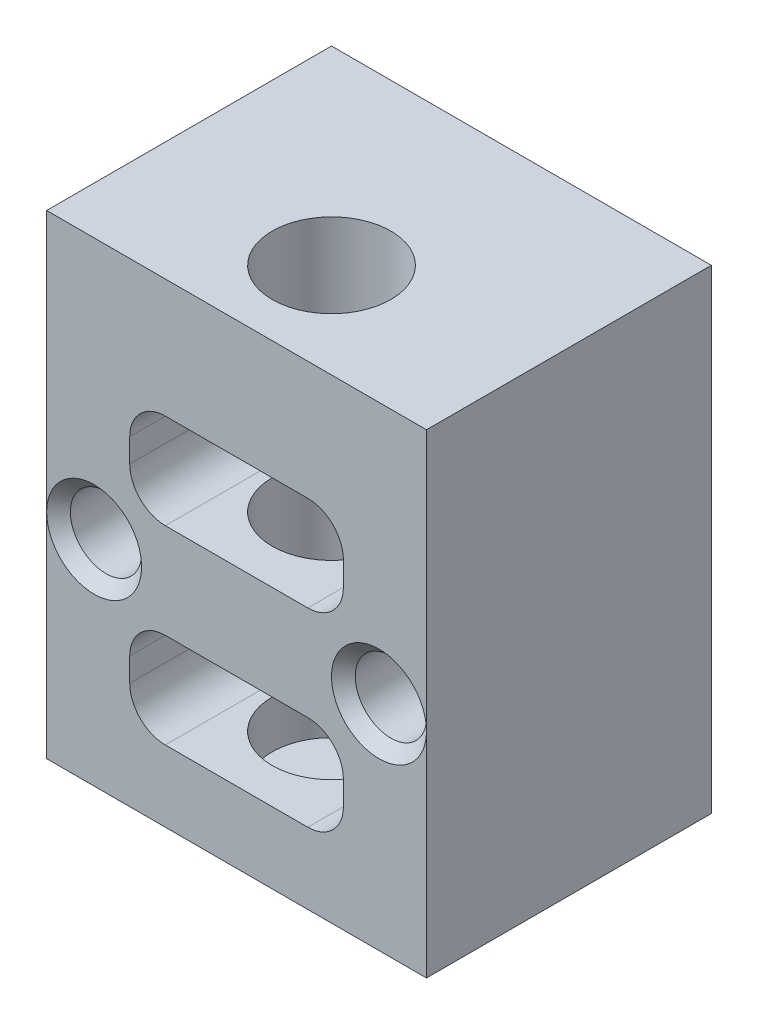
ISO-10303-21;
HEADER;
FILE_DESCRIPTION(('STEP AP214'),'2;1');
FILE_NAME('part.step','',(''),(''),'','','');
FILE_SCHEMA(('AUTOMOTIVE_DESIGN { 1 0 10303 214 1 1 1 1 }'));
ENDSEC;
DATA;
#1=APPLICATION_CONTEXT('core data for automotive mechanical design processes');
#2=APPLICATION_PROTOCOL_DEFINITION('international standard','automotive_design',2000,#1);
#3=PRODUCT_CONTEXT('',#1,'mechanical');
#4=PRODUCT('Part','Part','',(#3));
#5=PRODUCT_RELATED_PRODUCT_CATEGORY('part','',(#4));
#6=PRODUCT_DEFINITION_FORMATION('','',#4);
#7=PRODUCT_DEFINITION_CONTEXT('part definition',#1,'design');
#8=PRODUCT_DEFINITION('design','',#6,#7);
#9=PRODUCT_DEFINITION_SHAPE('','',#8);
#10=(LENGTH_UNIT() NAMED_UNIT(*) SI_UNIT(.MILLI.,.METRE.));
#11=(NAMED_UNIT(*) PLANE_ANGLE_UNIT() SI_UNIT($,.RADIAN.));
#12=(NAMED_UNIT(*) SI_UNIT($,.STERADIAN.) SOLID_ANGLE_UNIT());
#13=UNCERTAINTY_MEASURE_WITH_UNIT(LENGTH_MEASURE(1.E-05),#10,'distance_accuracy_value','');
#14=(GEOMETRIC_REPRESENTATION_CONTEXT(3) GLOBAL_UNCERTAINTY_ASSIGNED_CONTEXT((#13)) GLOBAL_UNIT_ASSIGNED_CONTEXT((#10,
#11,#12)) REPRESENTATION_CONTEXT('',''));
#15=CARTESIAN_POINT('',(0.,0.,0.));
#16=DIRECTION('',(0.,0.,1.));
#17=DIRECTION('',(1.,0.,0.));
#18=AXIS2_PLACEMENT_3D('',#15,#16,#17);
#19=CARTESIAN_POINT('',(0.,-9.,8.));
#20=DIRECTION('',(0.,1.,0.));
#21=DIRECTION('',(0.,0.,1.));
#22=AXIS2_PLACEMENT_3D('',#19,#20,#21);
#23=CYLINDRICAL_SURFACE('',#22,2.5);
#24=CARTESIAN_POINT('',(0.,5.,8.));
#25=DIRECTION('',(0.,1.,0.));
#26=DIRECTION('',(0.,0.,1.));
#27=AXIS2_PLACEMENT_3D('',#24,#25,#26);
#28=CIRCLE('',#27,2.5);
#29=CARTESIAN_POINT('',(0.,5.,10.5));
#30=VERTEX_POINT('',#29);
#31=EDGE_CURVE('E362',#30,#30,#28,.F.);
#32=ORIENTED_EDGE('',*,*,#31,.T.);
#33=EDGE_LOOP('',(#32));
#34=FACE_BOUND('',#33,.T.);
#35=CARTESIAN_POINT('',(0.,10.,8.));
#36=DIRECTION('',(0.,1.,0.));
#37=DIRECTION('',(0.,0.,1.));
#38=AXIS2_PLACEMENT_3D('',#35,#36,#37);
#39=CIRCLE('',#38,2.5);
#40=CARTESIAN_POINT('',(0.,10.,10.5));
#41=VERTEX_POINT('',#40);
#42=EDGE_CURVE('E320',#41,#41,#39,.T.);
#43=ORIENTED_EDGE('',*,*,#42,.T.);
#44=EDGE_LOOP('',(#43));
#45=FACE_BOUND('',#44,.T.);
#46=ADVANCED_FACE('F35',(#34,#45),#23,.F.);
#47=CARTESIAN_POINT('',(8.,-10.,12.));
#48=DIRECTION('',(-1.,0.,0.));
#49=DIRECTION('',(0.,0.,1.));
#50=AXIS2_PLACEMENT_3D('',#47,#48,#49);
#51=PLANE('',#50);
#52=DIRECTION('',(0.,1.,0.));
#53=VECTOR('',#52,1.);
#54=CARTESIAN_POINT('',(8.,-10.,0.));
#55=LINE('',#54,#53);
#56=CARTESIAN_POINT('',(8.,-10.,0.));
#57=VERTEX_POINT('',#56);
#58=CARTESIAN_POINT('',(8.,10.,0.));
#59=VERTEX_POINT('',#58);
#60=EDGE_CURVE('E319',#57,#59,#55,.T.);
#61=ORIENTED_EDGE('',*,*,#60,.T.);
#62=DIRECTION('',(0.,0.,-1.));
#63=VECTOR('',#62,1.);
#64=CARTESIAN_POINT('',(8.,10.,12.));
#65=LINE('',#64,#63);
#66=CARTESIAN_POINT('',(8.,10.,12.));
#67=VERTEX_POINT('',#66);
#68=EDGE_CURVE('E353',#67,#59,#65,.T.);
#69=ORIENTED_EDGE('',*,*,#68,.F.);
#70=DIRECTION('',(0.,1.,0.));
#71=VECTOR('',#70,1.);
#72=CARTESIAN_POINT('',(8.,-10.,12.));
#73=LINE('',#72,#71);
#74=CARTESIAN_POINT('',(8.,-0.999999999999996,12.));
#75=VERTEX_POINT('',#74);
#76=EDGE_CURVE('E328',#75,#67,#73,.T.);
#77=ORIENTED_EDGE('',*,*,#76,.F.);
#78=CARTESIAN_POINT('',(8.,-10.,12.));
#79=VERTEX_POINT('',#78);
#80=EDGE_CURVE('E324',#79,#75,#73,.T.);
#81=ORIENTED_EDGE('',*,*,#80,.F.);
#82=DIRECTION('',(0.,0.,-1.));
#83=VECTOR('',#82,1.);
#84=CARTESIAN_POINT('',(8.,-10.,12.));
#85=LINE('',#84,#83);
#86=EDGE_CURVE('E336',#79,#57,#85,.T.);
#87=ORIENTED_EDGE('',*,*,#86,.T.);
#88=EDGE_LOOP('',(#61,#69,#77,#81,#87));
#89=FACE_BOUND('',#88,.T.);
#90=ADVANCED_FACE('F381',(#89),#51,.F.);
#91=CARTESIAN_POINT('',(-8.,10.,12.));
#92=DIRECTION('',(0.,-1.,0.));
#93=DIRECTION('',(0.,0.,-1.));
#94=AXIS2_PLACEMENT_3D('',#91,#92,#93);
#95=PLANE('',#94);
#96=ORIENTED_EDGE('',*,*,#42,.F.);
#97=EDGE_LOOP('',(#96));
#98=FACE_BOUND('',#97,.T.);
#99=DIRECTION('',(-1.,0.,0.));
#100=VECTOR('',#99,1.);
#101=CARTESIAN_POINT('',(-8.,10.,0.));
#102=LINE('',#101,#100);
#103=CARTESIAN_POINT('',(-8.,10.,0.));
#104=VERTEX_POINT('',#103);
#105=EDGE_CURVE('E339',#59,#104,#102,.T.);
#106=ORIENTED_EDGE('',*,*,#105,.T.);
#107=DIRECTION('',(0.,0.,-1.));
#108=VECTOR('',#107,1.);
#109=CARTESIAN_POINT('',(-8.,10.,12.));
#110=LINE('',#109,#108);
#111=CARTESIAN_POINT('',(-8.,10.,12.));
#112=VERTEX_POINT('',#111);
#113=EDGE_CURVE('E350',#112,#104,#110,.T.);
#114=ORIENTED_EDGE('',*,*,#113,.F.);
#115=DIRECTION('',(-1.,0.,0.));
#116=VECTOR('',#115,1.);
#117=CARTESIAN_POINT('',(-8.,10.,12.));
#118=LINE('',#117,#116);
#119=EDGE_CURVE('E327',#67,#112,#118,.T.);
#120=ORIENTED_EDGE('',*,*,#119,.F.);
#121=ORIENTED_EDGE('',*,*,#68,.T.);
#122=EDGE_LOOP('',(#106,#114,#120,#121));
#123=FACE_BOUND('',#122,.T.);
#124=ADVANCED_FACE('F384',(#98,#123),#95,.F.);
#125=CARTESIAN_POINT('',(-8.,-10.,12.));
#126=DIRECTION('',(1.,0.,0.));
#127=DIRECTION('',(0.,0.,-1.));
#128=AXIS2_PLACEMENT_3D('',#125,#126,#127);
#129=PLANE('',#128);
#130=DIRECTION('',(0.,-1.,0.));
#131=VECTOR('',#130,1.);
#132=CARTESIAN_POINT('',(-8.,-10.,0.));
#133=LINE('',#132,#131);
#134=CARTESIAN_POINT('',(-8.,-10.,0.));
#135=VERTEX_POINT('',#134);
#136=EDGE_CURVE('E341',#104,#135,#133,.T.);
#137=ORIENTED_EDGE('',*,*,#136,.T.);
#138=DIRECTION('',(0.,0.,-1.));
#139=VECTOR('',#138,1.);
#140=CARTESIAN_POINT('',(-8.,-10.,12.));
#141=LINE('',#140,#139);
#142=CARTESIAN_POINT('',(-8.,-10.,12.));
#143=VERTEX_POINT('',#142);
#144=EDGE_CURVE('E347',#143,#135,#141,.T.);
#145=ORIENTED_EDGE('',*,*,#144,.F.);
#146=DIRECTION('',(0.,-1.,0.));
#147=VECTOR('',#146,1.);
#148=CARTESIAN_POINT('',(-8.,-10.,12.));
#149=LINE('',#148,#147);
#150=CARTESIAN_POINT('',(-8.,-0.999999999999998,12.));
#151=VERTEX_POINT('',#150);
#152=EDGE_CURVE('E330',#151,#143,#149,.T.);
#153=ORIENTED_EDGE('',*,*,#152,.F.);
#154=EDGE_CURVE('E331',#112,#151,#149,.T.);
#155=ORIENTED_EDGE('',*,*,#154,.F.);
#156=ORIENTED_EDGE('',*,*,#113,.T.);
#157=EDGE_LOOP('',(#137,#145,#153,#155,#156));
#158=FACE_BOUND('',#157,.T.);
#159=ADVANCED_FACE('F389',(#158),#129,.F.);
#160=CARTESIAN_POINT('',(-8.,-10.,12.));
#161=DIRECTION('',(0.,1.,0.));
#162=DIRECTION('',(0.,0.,1.));
#163=AXIS2_PLACEMENT_3D('',#160,#161,#162);
#164=PLANE('',#163);
#165=DIRECTION('',(1.,0.,0.));
#166=VECTOR('',#165,1.);
#167=CARTESIAN_POINT('',(-8.,-10.,0.));
#168=LINE('',#167,#166);
#169=EDGE_CURVE('E343',#135,#57,#168,.T.);
#170=ORIENTED_EDGE('',*,*,#169,.T.);
#171=ORIENTED_EDGE('',*,*,#86,.F.);
#172=DIRECTION('',(1.,0.,0.));
#173=VECTOR('',#172,1.);
#174=CARTESIAN_POINT('',(-8.,-10.,12.));
#175=LINE('',#174,#173);
#176=EDGE_CURVE('E334',#143,#79,#175,.T.);
#177=ORIENTED_EDGE('',*,*,#176,.F.);
#178=ORIENTED_EDGE('',*,*,#144,.T.);
#179=EDGE_LOOP('',(#170,#171,#177,#178));
#180=FACE_BOUND('',#179,.T.);
#181=ADVANCED_FACE('F395',(#180),#164,.F.);
#182=CARTESIAN_POINT('',(0.,0.,12.));
#183=DIRECTION('',(0.,0.,-1.));
#184=DIRECTION('',(-1.,0.,0.));
#185=AXIS2_PLACEMENT_3D('',#182,#183,#184);
#186=PLANE('',#185);
#187=DIRECTION('',(-1.,0.,0.));
#188=VECTOR('',#187,1.);
#189=CARTESIAN_POINT('',(-3.,5.,12.));
#190=LINE('',#189,#188);
#191=CARTESIAN_POINT('',(3.,5.,12.));
#192=VERTEX_POINT('',#191);
#193=CARTESIAN_POINT('',(-3.,5.,12.));
#194=VERTEX_POINT('',#193);
#195=EDGE_CURVE('E221',#192,#194,#190,.T.);
#196=ORIENTED_EDGE('',*,*,#195,.F.);
#197=CARTESIAN_POINT('',(3.,3.5,12.));
#198=DIRECTION('',(0.,0.,1.));
#199=DIRECTION('',(-1.,0.,0.));
#200=AXIS2_PLACEMENT_3D('',#197,#198,#199);
#201=CIRCLE('',#200,1.5);
#202=CARTESIAN_POINT('',(4.5,3.5,12.));
#203=VERTEX_POINT('',#202);
#204=EDGE_CURVE('E182',#203,#192,#201,.T.);
#205=ORIENTED_EDGE('',*,*,#204,.F.);
#206=DIRECTION('',(0.,1.,0.));
#207=VECTOR('',#206,1.);
#208=CARTESIAN_POINT('',(4.5,3.5,12.));
#209=LINE('',#208,#207);
#210=CARTESIAN_POINT('',(4.5,2.5,12.));
#211=VERTEX_POINT('',#210);
#212=EDGE_CURVE('E201',#211,#203,#209,.T.);
#213=ORIENTED_EDGE('',*,*,#212,.F.);
#214=CARTESIAN_POINT('',(3.,2.5,12.));
#215=DIRECTION('',(0.,0.,1.));
#216=DIRECTION('',(1.,0.,0.));
#217=AXIS2_PLACEMENT_3D('',#214,#215,#216);
#218=CIRCLE('',#217,1.5);
#219=CARTESIAN_POINT('',(3.,1.,12.));
#220=VERTEX_POINT('',#219);
#221=EDGE_CURVE('E204',#220,#211,#218,.T.);
#222=ORIENTED_EDGE('',*,*,#221,.F.);
#223=DIRECTION('',(1.,0.,0.));
#224=VECTOR('',#223,1.);
#225=CARTESIAN_POINT('',(-3.,1.,12.));
#226=LINE('',#225,#224);
#227=CARTESIAN_POINT('',(-3.,1.,12.));
#228=VERTEX_POINT('',#227);
#229=EDGE_CURVE('E233',#228,#220,#226,.T.);
#230=ORIENTED_EDGE('',*,*,#229,.F.);
#231=CARTESIAN_POINT('',(-3.,2.5,12.));
#232=DIRECTION('',(0.,0.,1.));
#233=DIRECTION('',(1.,0.,0.));
#234=AXIS2_PLACEMENT_3D('',#231,#232,#233);
#235=CIRCLE('',#234,1.5);
#236=CARTESIAN_POINT('',(-4.5,2.5,12.));
#237=VERTEX_POINT('',#236);
#238=EDGE_CURVE('E230',#237,#228,#235,.T.);
#239=ORIENTED_EDGE('',*,*,#238,.F.);
#240=DIRECTION('',(0.,-1.,0.));
#241=VECTOR('',#240,1.);
#242=CARTESIAN_POINT('',(-4.5,3.5,12.));
#243=LINE('',#242,#241);
#244=CARTESIAN_POINT('',(-4.5,3.5,12.));
#245=VERTEX_POINT('',#244);
#246=EDGE_CURVE('E227',#245,#237,#243,.T.);
#247=ORIENTED_EDGE('',*,*,#246,.F.);
#248=CARTESIAN_POINT('',(-3.,3.5,12.));
#249=DIRECTION('',(0.,0.,1.));
#250=DIRECTION('',(1.,0.,0.));
#251=AXIS2_PLACEMENT_3D('',#248,#249,#250);
#252=CIRCLE('',#251,1.5);
#253=EDGE_CURVE('E224',#194,#245,#252,.T.);
#254=ORIENTED_EDGE('',*,*,#253,.F.);
#255=EDGE_LOOP('',(#196,#205,#213,#222,#230,#239,#247,#254));
#256=FACE_BOUND('',#255,.T.);
#257=DIRECTION('',(1.,0.,0.));
#258=VECTOR('',#257,1.);
#259=CARTESIAN_POINT('',(-3.,-7.,12.));
#260=LINE('',#259,#258);
#261=CARTESIAN_POINT('',(-3.,-7.,12.));
#262=VERTEX_POINT('',#261);
#263=CARTESIAN_POINT('',(3.,-7.,12.));
#264=VERTEX_POINT('',#263);
#265=EDGE_CURVE('E280',#262,#264,#260,.T.);
#266=ORIENTED_EDGE('',*,*,#265,.F.);
#267=CARTESIAN_POINT('',(-3.,-5.5,12.));
#268=DIRECTION('',(0.,0.,1.));
#269=DIRECTION('',(-1.,0.,0.));
#270=AXIS2_PLACEMENT_3D('',#267,#268,#269);
#271=CIRCLE('',#270,1.5);
#272=CARTESIAN_POINT('',(-4.5,-5.5,12.));
#273=VERTEX_POINT('',#272);
#274=EDGE_CURVE('E278',#273,#262,#271,.T.);
#275=ORIENTED_EDGE('',*,*,#274,.F.);
#276=DIRECTION('',(0.,-1.,0.));
#277=VECTOR('',#276,1.);
#278=CARTESIAN_POINT('',(-4.5,-5.5,12.));
#279=LINE('',#278,#277);
#280=CARTESIAN_POINT('',(-4.5,-4.5,12.));
#281=VERTEX_POINT('',#280);
#282=EDGE_CURVE('E256',#281,#273,#279,.T.);
#283=ORIENTED_EDGE('',*,*,#282,.F.);
#284=CARTESIAN_POINT('',(-3.,-4.5,12.));
#285=DIRECTION('',(0.,0.,1.));
#286=DIRECTION('',(-1.,0.,0.));
#287=AXIS2_PLACEMENT_3D('',#284,#285,#286);
#288=CIRCLE('',#287,1.5);
#289=CARTESIAN_POINT('',(-3.,-3.,12.));
#290=VERTEX_POINT('',#289);
#291=EDGE_CURVE('E296',#290,#281,#288,.T.);
#292=ORIENTED_EDGE('',*,*,#291,.F.);
#293=DIRECTION('',(-1.,0.,0.));
#294=VECTOR('',#293,1.);
#295=CARTESIAN_POINT('',(-3.,-3.,12.));
#296=LINE('',#295,#294);
#297=CARTESIAN_POINT('',(3.,-3.,12.));
#298=VERTEX_POINT('',#297);
#299=EDGE_CURVE('E293',#298,#290,#296,.T.);
#300=ORIENTED_EDGE('',*,*,#299,.F.);
#301=CARTESIAN_POINT('',(3.,-4.5,12.));
#302=DIRECTION('',(0.,0.,1.));
#303=DIRECTION('',(-1.,0.,0.));
#304=AXIS2_PLACEMENT_3D('',#301,#302,#303);
#305=CIRCLE('',#304,1.5);
#306=CARTESIAN_POINT('',(4.5,-4.5,12.));
#307=VERTEX_POINT('',#306);
#308=EDGE_CURVE('E290',#307,#298,#305,.T.);
#309=ORIENTED_EDGE('',*,*,#308,.F.);
#310=DIRECTION('',(0.,1.,0.));
#311=VECTOR('',#310,1.);
#312=CARTESIAN_POINT('',(4.5,-5.5,12.));
#313=LINE('',#312,#311);
#314=CARTESIAN_POINT('',(4.5,-5.5,12.));
#315=VERTEX_POINT('',#314);
#316=EDGE_CURVE('E287',#315,#307,#313,.T.);
#317=ORIENTED_EDGE('',*,*,#316,.F.);
#318=CARTESIAN_POINT('',(3.,-5.5,12.));
#319=DIRECTION('',(0.,0.,1.));
#320=DIRECTION('',(1.,0.,0.));
#321=AXIS2_PLACEMENT_3D('',#318,#319,#320);
#322=CIRCLE('',#321,1.5);
#323=EDGE_CURVE('E284',#264,#315,#322,.T.);
#324=ORIENTED_EDGE('',*,*,#323,.F.);
#325=EDGE_LOOP('',(#266,#275,#283,#292,#300,#309,#317,#324));
#326=FACE_BOUND('',#325,.T.);
#327=ORIENTED_EDGE('',*,*,#80,.T.);
#328=CARTESIAN_POINT('',(6.,-0.999999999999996,12.));
#329=DIRECTION('',(0.,0.,-1.));
#330=DIRECTION('',(-1.,0.,0.));
#331=AXIS2_PLACEMENT_3D('',#328,#329,#330);
#332=CIRCLE('',#331,2.);
#333=EDGE_CURVE('E43',#75,#75,#332,.T.);
#334=ORIENTED_EDGE('',*,*,#333,.T.);
#335=ORIENTED_EDGE('',*,*,#76,.T.);
#336=ORIENTED_EDGE('',*,*,#119,.T.);
#337=ORIENTED_EDGE('',*,*,#154,.T.);
#338=CARTESIAN_POINT('',(-6.,-0.999999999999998,12.));
#339=DIRECTION('',(0.,0.,-1.));
#340=DIRECTION('',(-1.,0.,0.));
#341=AXIS2_PLACEMENT_3D('',#338,#339,#340);
#342=CIRCLE('',#341,2.);
#343=EDGE_CURVE('E48',#151,#151,#342,.T.);
#344=ORIENTED_EDGE('',*,*,#343,.T.);
#345=ORIENTED_EDGE('',*,*,#152,.T.);
#346=ORIENTED_EDGE('',*,*,#176,.T.);
#347=EDGE_LOOP('',(#327,#334,#335,#336,#337,#344,#345,#346));
#348=FACE_BOUND('',#347,.T.);
#349=ADVANCED_FACE('F376',(#256,#326,#348),#186,.F.);
#350=CARTESIAN_POINT('',(0.,0.,0.));
#351=DIRECTION('',(0.,0.,-1.));
#352=DIRECTION('',(-1.,0.,0.));
#353=AXIS2_PLACEMENT_3D('',#350,#351,#352);
#354=PLANE('',#353);
#355=CARTESIAN_POINT('',(-6.,-0.999999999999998,0.));
#356=DIRECTION('',(0.,0.,-1.));
#357=DIRECTION('',(-1.,0.,0.));
#358=AXIS2_PLACEMENT_3D('',#355,#356,#357);
#359=CIRCLE('',#358,1.5);
#360=CARTESIAN_POINT('',(-7.5,-0.999999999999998,0.));
#361=VERTEX_POINT('',#360);
#362=EDGE_CURVE('E281',#361,#361,#359,.T.);
#363=ORIENTED_EDGE('',*,*,#362,.F.);
#364=EDGE_LOOP('',(#363));
#365=FACE_BOUND('',#364,.T.);
#366=CARTESIAN_POINT('',(6.,-0.999999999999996,0.));
#367=DIRECTION('',(0.,0.,-1.));
#368=DIRECTION('',(-1.,0.,0.));
#369=AXIS2_PLACEMENT_3D('',#366,#367,#368);
#370=CIRCLE('',#369,1.5);
#371=CARTESIAN_POINT('',(4.5,-0.999999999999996,0.));
#372=VERTEX_POINT('',#371);
#373=EDGE_CURVE('E367',#372,#372,#370,.T.);
#374=ORIENTED_EDGE('',*,*,#373,.F.);
#375=EDGE_LOOP('',(#374));
#376=FACE_BOUND('',#375,.T.);
#377=ORIENTED_EDGE('',*,*,#60,.F.);
#378=ORIENTED_EDGE('',*,*,#169,.F.);
#379=ORIENTED_EDGE('',*,*,#136,.F.);
#380=ORIENTED_EDGE('',*,*,#105,.F.);
#381=EDGE_LOOP('',(#377,#378,#379,#380));
#382=FACE_BOUND('',#381,.T.);
#383=ADVANCED_FACE('F398',(#365,#376,#382),#354,.T.);
#384=CARTESIAN_POINT('',(-3.,-3.,3.5));
#385=DIRECTION('',(0.,1.,0.));
#386=DIRECTION('',(0.,0.,1.));
#387=AXIS2_PLACEMENT_3D('',#384,#385,#386);
#388=PLANE('',#387);
#389=ORIENTED_EDGE('',*,*,#299,.T.);
#390=DIRECTION('',(0.,0.,1.));
#391=VECTOR('',#390,1.);
#392=CARTESIAN_POINT('',(-3.,-3.,3.5));
#393=LINE('',#392,#391);
#394=CARTESIAN_POINT('',(-3.,-3.,3.5));
#395=VERTEX_POINT('',#394);
#396=EDGE_CURVE('E304',#395,#290,#393,.T.);
#397=ORIENTED_EDGE('',*,*,#396,.F.);
#398=DIRECTION('',(-1.,0.,0.));
#399=VECTOR('',#398,1.);
#400=CARTESIAN_POINT('',(-3.,-3.,3.5));
#401=LINE('',#400,#399);
#402=CARTESIAN_POINT('',(3.,-3.,3.5));
#403=VERTEX_POINT('',#402);
#404=EDGE_CURVE('E268',#403,#395,#401,.T.);
#405=ORIENTED_EDGE('',*,*,#404,.F.);
#406=DIRECTION('',(0.,0.,1.));
#407=VECTOR('',#406,1.);
#408=CARTESIAN_POINT('',(3.,-3.,3.5));
#409=LINE('',#408,#407);
#410=EDGE_CURVE('E306',#403,#298,#409,.T.);
#411=ORIENTED_EDGE('',*,*,#410,.T.);
#412=EDGE_LOOP('',(#389,#397,#405,#411));
#413=FACE_BOUND('',#412,.T.);
#414=CARTESIAN_POINT('',(0.,-3.,8.));
#415=DIRECTION('',(0.,1.,0.));
#416=DIRECTION('',(0.,0.,1.));
#417=AXIS2_PLACEMENT_3D('',#414,#415,#416);
#418=CIRCLE('',#417,2.5);
#419=CARTESIAN_POINT('',(0.,-3.,10.5));
#420=VERTEX_POINT('',#419);
#421=EDGE_CURVE('E359',#420,#420,#418,.F.);
#422=ORIENTED_EDGE('',*,*,#421,.F.);
#423=EDGE_LOOP('',(#422));
#424=FACE_BOUND('',#423,.T.);
#425=ADVANCED_FACE('F400',(#413,#424),#388,.F.);
#426=CARTESIAN_POINT('',(-3.,-7.,3.5));
#427=DIRECTION('',(0.,-1.,0.));
#428=DIRECTION('',(0.,0.,-1.));
#429=AXIS2_PLACEMENT_3D('',#426,#427,#428);
#430=PLANE('',#429);
#431=ORIENTED_EDGE('',*,*,#265,.T.);
#432=DIRECTION('',(0.,0.,1.));
#433=VECTOR('',#432,1.);
#434=CARTESIAN_POINT('',(3.,-7.,3.5));
#435=LINE('',#434,#433);
#436=CARTESIAN_POINT('',(3.,-7.,3.5));
#437=VERTEX_POINT('',#436);
#438=EDGE_CURVE('E312',#437,#264,#435,.T.);
#439=ORIENTED_EDGE('',*,*,#438,.F.);
#440=DIRECTION('',(1.,0.,0.));
#441=VECTOR('',#440,1.);
#442=CARTESIAN_POINT('',(-3.,-7.,3.5));
#443=LINE('',#442,#441);
#444=CARTESIAN_POINT('',(-3.,-7.,3.5));
#445=VERTEX_POINT('',#444);
#446=EDGE_CURVE('E255',#445,#437,#443,.T.);
#447=ORIENTED_EDGE('',*,*,#446,.F.);
#448=DIRECTION('',(0.,0.,1.));
#449=VECTOR('',#448,1.);
#450=CARTESIAN_POINT('',(-3.,-7.,3.5));
#451=LINE('',#450,#449);
#452=EDGE_CURVE('E277',#445,#262,#451,.T.);
#453=ORIENTED_EDGE('',*,*,#452,.T.);
#454=EDGE_LOOP('',(#431,#439,#447,#453));
#455=FACE_BOUND('',#454,.T.);
#456=CARTESIAN_POINT('',(0.,-7.,8.));
#457=DIRECTION('',(0.,-1.,0.));
#458=DIRECTION('',(0.,0.,-1.));
#459=AXIS2_PLACEMENT_3D('',#456,#457,#458);
#460=CIRCLE('',#459,2.5);
#461=CARTESIAN_POINT('',(0.,-7.,5.5));
#462=VERTEX_POINT('',#461);
#463=EDGE_CURVE('E240',#462,#462,#460,.F.);
#464=ORIENTED_EDGE('',*,*,#463,.F.);
#465=EDGE_LOOP('',(#464));
#466=FACE_BOUND('',#465,.T.);
#467=ADVANCED_FACE('F407',(#455,#466),#430,.F.);
#468=CARTESIAN_POINT('',(-3.,-5.5,3.5));
#469=DIRECTION('',(0.,0.,1.));
#470=DIRECTION('',(1.,0.,0.));
#471=AXIS2_PLACEMENT_3D('',#468,#469,#470);
#472=CYLINDRICAL_SURFACE('',#471,1.5);
#473=ORIENTED_EDGE('',*,*,#274,.T.);
#474=ORIENTED_EDGE('',*,*,#452,.F.);
#475=CARTESIAN_POINT('',(-3.,-5.5,3.5));
#476=DIRECTION('',(0.,0.,1.));
#477=DIRECTION('',(-1.,0.,0.));
#478=AXIS2_PLACEMENT_3D('',#475,#476,#477);
#479=CIRCLE('',#478,1.5);
#480=CARTESIAN_POINT('',(-4.5,-5.5,3.5));
#481=VERTEX_POINT('',#480);
#482=EDGE_CURVE('E252',#481,#445,#479,.T.);
#483=ORIENTED_EDGE('',*,*,#482,.F.);
#484=DIRECTION('',(0.,0.,1.));
#485=VECTOR('',#484,1.);
#486=CARTESIAN_POINT('',(-4.5,-5.5,3.5));
#487=LINE('',#486,#485);
#488=EDGE_CURVE('E222',#481,#273,#487,.T.);
#489=ORIENTED_EDGE('',*,*,#488,.T.);
#490=EDGE_LOOP('',(#473,#474,#483,#489));
#491=FACE_BOUND('',#490,.T.);
#492=ADVANCED_FACE('F461',(#491),#472,.F.);
#493=CARTESIAN_POINT('',(-4.5,-5.5,3.5));
#494=DIRECTION('',(-1.,0.,0.));
#495=DIRECTION('',(0.,0.,1.));
#496=AXIS2_PLACEMENT_3D('',#493,#494,#495);
#497=PLANE('',#496);
#498=ORIENTED_EDGE('',*,*,#282,.T.);
#499=ORIENTED_EDGE('',*,*,#488,.F.);
#500=DIRECTION('',(0.,-1.,0.));
#501=VECTOR('',#500,1.);
#502=CARTESIAN_POINT('',(-4.5,-5.5,3.5));
#503=LINE('',#502,#501);
#504=CARTESIAN_POINT('',(-4.5,-4.5,3.5));
#505=VERTEX_POINT('',#504);
#506=EDGE_CURVE('E274',#505,#481,#503,.T.);
#507=ORIENTED_EDGE('',*,*,#506,.F.);
#508=DIRECTION('',(0.,0.,1.));
#509=VECTOR('',#508,1.);
#510=CARTESIAN_POINT('',(-4.5,-4.5,3.5));
#511=LINE('',#510,#509);
#512=EDGE_CURVE('E302',#505,#281,#511,.T.);
#513=ORIENTED_EDGE('',*,*,#512,.T.);
#514=EDGE_LOOP('',(#498,#499,#507,#513));
#515=FACE_BOUND('',#514,.T.);
#516=ADVANCED_FACE('F457',(#515),#497,.F.);
#517=CARTESIAN_POINT('',(-3.,-4.5,3.5));
#518=DIRECTION('',(0.,0.,1.));
#519=DIRECTION('',(1.,0.,0.));
#520=AXIS2_PLACEMENT_3D('',#517,#518,#519);
#521=CYLINDRICAL_SURFACE('',#520,1.5);
#522=ORIENTED_EDGE('',*,*,#291,.T.);
#523=ORIENTED_EDGE('',*,*,#512,.F.);
#524=CARTESIAN_POINT('',(-3.,-4.5,3.5));
#525=DIRECTION('',(0.,0.,1.));
#526=DIRECTION('',(-1.,0.,0.));
#527=AXIS2_PLACEMENT_3D('',#524,#525,#526);
#528=CIRCLE('',#527,1.5);
#529=EDGE_CURVE('E271',#395,#505,#528,.T.);
#530=ORIENTED_EDGE('',*,*,#529,.F.);
#531=ORIENTED_EDGE('',*,*,#396,.T.);
#532=EDGE_LOOP('',(#522,#523,#530,#531));
#533=FACE_BOUND('',#532,.T.);
#534=ADVANCED_FACE('F460',(#533),#521,.F.);
#535=CARTESIAN_POINT('',(3.,-4.5,3.5));
#536=DIRECTION('',(0.,0.,1.));
#537=DIRECTION('',(1.,0.,0.));
#538=AXIS2_PLACEMENT_3D('',#535,#536,#537);
#539=CYLINDRICAL_SURFACE('',#538,1.5);
#540=ORIENTED_EDGE('',*,*,#308,.T.);
#541=ORIENTED_EDGE('',*,*,#410,.F.);
#542=CARTESIAN_POINT('',(3.,-4.5,3.5));
#543=DIRECTION('',(0.,0.,1.));
#544=DIRECTION('',(-1.,0.,0.));
#545=AXIS2_PLACEMENT_3D('',#542,#543,#544);
#546=CIRCLE('',#545,1.5);
#547=CARTESIAN_POINT('',(4.5,-4.5,3.5));
#548=VERTEX_POINT('',#547);
#549=EDGE_CURVE('E265',#548,#403,#546,.T.);
#550=ORIENTED_EDGE('',*,*,#549,.F.);
#551=DIRECTION('',(0.,0.,1.));
#552=VECTOR('',#551,1.);
#553=CARTESIAN_POINT('',(4.5,-4.5,3.5));
#554=LINE('',#553,#552);
#555=EDGE_CURVE('E308',#548,#307,#554,.T.);
#556=ORIENTED_EDGE('',*,*,#555,.T.);
#557=EDGE_LOOP('',(#540,#541,#550,#556));
#558=FACE_BOUND('',#557,.T.);
#559=ADVANCED_FACE('F464',(#558),#539,.F.);
#560=CARTESIAN_POINT('',(4.5,-5.5,3.5));
#561=DIRECTION('',(1.,0.,0.));
#562=DIRECTION('',(0.,0.,-1.));
#563=AXIS2_PLACEMENT_3D('',#560,#561,#562);
#564=PLANE('',#563);
#565=ORIENTED_EDGE('',*,*,#316,.T.);
#566=ORIENTED_EDGE('',*,*,#555,.F.);
#567=DIRECTION('',(0.,1.,0.));
#568=VECTOR('',#567,1.);
#569=CARTESIAN_POINT('',(4.5,-5.5,3.5));
#570=LINE('',#569,#568);
#571=CARTESIAN_POINT('',(4.5,-5.5,3.5));
#572=VERTEX_POINT('',#571);
#573=EDGE_CURVE('E262',#572,#548,#570,.T.);
#574=ORIENTED_EDGE('',*,*,#573,.F.);
#575=DIRECTION('',(0.,0.,1.));
#576=VECTOR('',#575,1.);
#577=CARTESIAN_POINT('',(4.5,-5.5,3.5));
#578=LINE('',#577,#576);
#579=EDGE_CURVE('E310',#572,#315,#578,.T.);
#580=ORIENTED_EDGE('',*,*,#579,.T.);
#581=EDGE_LOOP('',(#565,#566,#574,#580));
#582=FACE_BOUND('',#581,.T.);
#583=ADVANCED_FACE('F451',(#582),#564,.F.);
#584=CARTESIAN_POINT('',(3.,-5.5,3.5));
#585=DIRECTION('',(0.,0.,1.));
#586=DIRECTION('',(1.,0.,0.));
#587=AXIS2_PLACEMENT_3D('',#584,#585,#586);
#588=CYLINDRICAL_SURFACE('',#587,1.5);
#589=ORIENTED_EDGE('',*,*,#323,.T.);
#590=ORIENTED_EDGE('',*,*,#579,.F.);
#591=CARTESIAN_POINT('',(3.,-5.5,3.5));
#592=DIRECTION('',(0.,0.,1.));
#593=DIRECTION('',(1.,0.,0.));
#594=AXIS2_PLACEMENT_3D('',#591,#592,#593);
#595=CIRCLE('',#594,1.5);
#596=EDGE_CURVE('E259',#437,#572,#595,.T.);
#597=ORIENTED_EDGE('',*,*,#596,.F.);
#598=ORIENTED_EDGE('',*,*,#438,.T.);
#599=EDGE_LOOP('',(#589,#590,#597,#598));
#600=FACE_BOUND('',#599,.T.);
#601=ADVANCED_FACE('F440',(#600),#588,.F.);
#602=CARTESIAN_POINT('',(-3.,-5.5,3.5));
#603=DIRECTION('',(0.,0.,-1.));
#604=DIRECTION('',(-1.,0.,0.));
#605=AXIS2_PLACEMENT_3D('',#602,#603,#604);
#606=PLANE('',#605);
#607=ORIENTED_EDGE('',*,*,#482,.T.);
#608=ORIENTED_EDGE('',*,*,#446,.T.);
#609=ORIENTED_EDGE('',*,*,#596,.T.);
#610=ORIENTED_EDGE('',*,*,#573,.T.);
#611=ORIENTED_EDGE('',*,*,#549,.T.);
#612=ORIENTED_EDGE('',*,*,#404,.T.);
#613=ORIENTED_EDGE('',*,*,#529,.T.);
#614=ORIENTED_EDGE('',*,*,#506,.T.);
#615=EDGE_LOOP('',(#607,#608,#609,#610,#611,#612,#613,#614));
#616=FACE_BOUND('',#615,.T.);
#617=ADVANCED_FACE('F432',(#616),#606,.F.);
#618=CARTESIAN_POINT('',(0.,1.,8.));
#619=DIRECTION('',(0.,-1.,0.));
#620=DIRECTION('',(0.,0.,-1.));
#621=AXIS2_PLACEMENT_3D('',#618,#619,#620);
#622=CIRCLE('',#621,2.5);
#623=CARTESIAN_POINT('',(0.,1.,5.5));
#624=VERTEX_POINT('',#623);
#625=EDGE_CURVE('E323',#624,#624,#622,.F.);
#626=ORIENTED_EDGE('',*,*,#625,.T.);
#627=EDGE_LOOP('',(#626));
#628=FACE_BOUND('',#627,.T.);
#629=ORIENTED_EDGE('',*,*,#421,.T.);
#630=EDGE_LOOP('',(#629));
#631=FACE_BOUND('',#630,.T.);
#632=ADVANCED_FACE('F419',(#628,#631),#23,.F.);
#633=CARTESIAN_POINT('',(-3.,1.,3.5));
#634=DIRECTION('',(0.,-1.,0.));
#635=DIRECTION('',(0.,0.,-1.));
#636=AXIS2_PLACEMENT_3D('',#633,#634,#635);
#637=PLANE('',#636);
#638=ORIENTED_EDGE('',*,*,#229,.T.);
#639=DIRECTION('',(0.,0.,1.));
#640=VECTOR('',#639,1.);
#641=CARTESIAN_POINT('',(3.,1.,3.5));
#642=LINE('',#641,#640);
#643=CARTESIAN_POINT('',(3.,1.,3.5));
#644=VERTEX_POINT('',#643);
#645=EDGE_CURVE('E243',#644,#220,#642,.T.);
#646=ORIENTED_EDGE('',*,*,#645,.F.);
#647=DIRECTION('',(1.,0.,0.));
#648=VECTOR('',#647,1.);
#649=CARTESIAN_POINT('',(-3.,1.,3.5));
#650=LINE('',#649,#648);
#651=CARTESIAN_POINT('',(-3.,1.,3.5));
#652=VERTEX_POINT('',#651);
#653=EDGE_CURVE('E214',#652,#644,#650,.T.);
#654=ORIENTED_EDGE('',*,*,#653,.F.);
#655=DIRECTION('',(0.,0.,1.));
#656=VECTOR('',#655,1.);
#657=CARTESIAN_POINT('',(-3.,1.,3.5));
#658=LINE('',#657,#656);
#659=EDGE_CURVE('E245',#652,#228,#658,.T.);
#660=ORIENTED_EDGE('',*,*,#659,.T.);
#661=EDGE_LOOP('',(#638,#646,#654,#660));
#662=FACE_BOUND('',#661,.T.);
#663=ORIENTED_EDGE('',*,*,#625,.F.);
#664=EDGE_LOOP('',(#663));
#665=FACE_BOUND('',#664,.T.);
#666=ADVANCED_FACE('F431',(#662,#665),#637,.F.);
#667=CARTESIAN_POINT('',(-3.,5.,3.5));
#668=DIRECTION('',(0.,1.,0.));
#669=DIRECTION('',(0.,0.,1.));
#670=AXIS2_PLACEMENT_3D('',#667,#668,#669);
#671=PLANE('',#670);
#672=ORIENTED_EDGE('',*,*,#195,.T.);
#673=DIRECTION('',(0.,0.,1.));
#674=VECTOR('',#673,1.);
#675=CARTESIAN_POINT('',(-3.,5.,3.5));
#676=LINE('',#675,#674);
#677=CARTESIAN_POINT('',(-3.,5.,3.5));
#678=VERTEX_POINT('',#677);
#679=EDGE_CURVE('E186',#678,#194,#676,.T.);
#680=ORIENTED_EDGE('',*,*,#679,.F.);
#681=DIRECTION('',(-1.,0.,0.));
#682=VECTOR('',#681,1.);
#683=CARTESIAN_POINT('',(-3.,5.,3.5));
#684=LINE('',#683,#682);
#685=CARTESIAN_POINT('',(3.,5.,3.5));
#686=VERTEX_POINT('',#685);
#687=EDGE_CURVE('E190',#686,#678,#684,.T.);
#688=ORIENTED_EDGE('',*,*,#687,.F.);
#689=DIRECTION('',(0.,0.,1.));
#690=VECTOR('',#689,1.);
#691=CARTESIAN_POINT('',(3.,5.,3.5));
#692=LINE('',#691,#690);
#693=EDGE_CURVE('E175',#686,#192,#692,.T.);
#694=ORIENTED_EDGE('',*,*,#693,.T.);
#695=EDGE_LOOP('',(#672,#680,#688,#694));
#696=FACE_BOUND('',#695,.T.);
#697=ORIENTED_EDGE('',*,*,#31,.F.);
#698=EDGE_LOOP('',(#697));
#699=FACE_BOUND('',#698,.T.);
#700=ADVANCED_FACE('F191',(#696,#699),#671,.F.);
#701=CARTESIAN_POINT('',(3.,3.5,3.5));
#702=DIRECTION('',(0.,0.,1.));
#703=DIRECTION('',(1.,0.,0.));
#704=AXIS2_PLACEMENT_3D('',#701,#702,#703);
#705=CYLINDRICAL_SURFACE('',#704,1.5);
#706=ORIENTED_EDGE('',*,*,#204,.T.);
#707=ORIENTED_EDGE('',*,*,#693,.F.);
#708=CARTESIAN_POINT('',(3.,3.5,3.5));
#709=DIRECTION('',(0.,0.,1.));
#710=DIRECTION('',(-1.,0.,0.));
#711=AXIS2_PLACEMENT_3D('',#708,#709,#710);
#712=CIRCLE('',#711,1.5);
#713=CARTESIAN_POINT('',(4.5,3.5,3.5));
#714=VERTEX_POINT('',#713);
#715=EDGE_CURVE('E179',#714,#686,#712,.T.);
#716=ORIENTED_EDGE('',*,*,#715,.F.);
#717=DIRECTION('',(0.,0.,1.));
#718=VECTOR('',#717,1.);
#719=CARTESIAN_POINT('',(4.5,3.5,3.5));
#720=LINE('',#719,#718);
#721=EDGE_CURVE('E238',#714,#203,#720,.T.);
#722=ORIENTED_EDGE('',*,*,#721,.T.);
#723=EDGE_LOOP('',(#706,#707,#716,#722));
#724=FACE_BOUND('',#723,.T.);
#725=ADVANCED_FACE('F177',(#724),#705,.F.);
#726=CARTESIAN_POINT('',(4.5,3.5,3.5));
#727=DIRECTION('',(1.,0.,0.));
#728=DIRECTION('',(0.,0.,-1.));
#729=AXIS2_PLACEMENT_3D('',#726,#727,#728);
#730=PLANE('',#729);
#731=ORIENTED_EDGE('',*,*,#212,.T.);
#732=ORIENTED_EDGE('',*,*,#721,.F.);
#733=DIRECTION('',(0.,1.,0.));
#734=VECTOR('',#733,1.);
#735=CARTESIAN_POINT('',(4.5,3.5,3.5));
#736=LINE('',#735,#734);
#737=CARTESIAN_POINT('',(4.5,2.5,3.5));
#738=VERTEX_POINT('',#737);
#739=EDGE_CURVE('E187',#738,#714,#736,.T.);
#740=ORIENTED_EDGE('',*,*,#739,.F.);
#741=DIRECTION('',(0.,0.,1.));
#742=VECTOR('',#741,1.);
#743=CARTESIAN_POINT('',(4.5,2.5,3.5));
#744=LINE('',#743,#742);
#745=EDGE_CURVE('E241',#738,#211,#744,.T.);
#746=ORIENTED_EDGE('',*,*,#745,.T.);
#747=EDGE_LOOP('',(#731,#732,#740,#746));
#748=FACE_BOUND('',#747,.T.);
#749=ADVANCED_FACE('F496',(#748),#730,.F.);
#750=CARTESIAN_POINT('',(3.,2.5,3.5));
#751=DIRECTION('',(0.,0.,1.));
#752=DIRECTION('',(1.,0.,0.));
#753=AXIS2_PLACEMENT_3D('',#750,#751,#752);
#754=CYLINDRICAL_SURFACE('',#753,1.5);
#755=ORIENTED_EDGE('',*,*,#221,.T.);
#756=ORIENTED_EDGE('',*,*,#745,.F.);
#757=CARTESIAN_POINT('',(3.,2.5,3.5));
#758=DIRECTION('',(0.,0.,1.));
#759=DIRECTION('',(1.,0.,0.));
#760=AXIS2_PLACEMENT_3D('',#757,#758,#759);
#761=CIRCLE('',#760,1.5);
#762=EDGE_CURVE('E217',#644,#738,#761,.T.);
#763=ORIENTED_EDGE('',*,*,#762,.F.);
#764=ORIENTED_EDGE('',*,*,#645,.T.);
#765=EDGE_LOOP('',(#755,#756,#763,#764));
#766=FACE_BOUND('',#765,.T.);
#767=ADVANCED_FACE('F499',(#766),#754,.F.);
#768=CARTESIAN_POINT('',(-3.,2.5,3.5));
#769=DIRECTION('',(0.,0.,1.));
#770=DIRECTION('',(1.,0.,0.));
#771=AXIS2_PLACEMENT_3D('',#768,#769,#770);
#772=CYLINDRICAL_SURFACE('',#771,1.5);
#773=ORIENTED_EDGE('',*,*,#238,.T.);
#774=ORIENTED_EDGE('',*,*,#659,.F.);
#775=CARTESIAN_POINT('',(-3.,2.5,3.5));
#776=DIRECTION('',(0.,0.,1.));
#777=DIRECTION('',(1.,0.,0.));
#778=AXIS2_PLACEMENT_3D('',#775,#776,#777);
#779=CIRCLE('',#778,1.5);
#780=CARTESIAN_POINT('',(-4.5,2.5,3.5));
#781=VERTEX_POINT('',#780);
#782=EDGE_CURVE('E211',#781,#652,#779,.T.);
#783=ORIENTED_EDGE('',*,*,#782,.F.);
#784=DIRECTION('',(0.,0.,1.));
#785=VECTOR('',#784,1.);
#786=CARTESIAN_POINT('',(-4.5,2.5,3.5));
#787=LINE('',#786,#785);
#788=EDGE_CURVE('E247',#781,#237,#787,.T.);
#789=ORIENTED_EDGE('',*,*,#788,.T.);
#790=EDGE_LOOP('',(#773,#774,#783,#789));
#791=FACE_BOUND('',#790,.T.);
#792=ADVANCED_FACE('F502',(#791),#772,.F.);
#793=CARTESIAN_POINT('',(-4.5,3.5,3.5));
#794=DIRECTION('',(-1.,0.,0.));
#795=DIRECTION('',(0.,0.,1.));
#796=AXIS2_PLACEMENT_3D('',#793,#794,#795);
#797=PLANE('',#796);
#798=ORIENTED_EDGE('',*,*,#246,.T.);
#799=ORIENTED_EDGE('',*,*,#788,.F.);
#800=DIRECTION('',(0.,-1.,0.));
#801=VECTOR('',#800,1.);
#802=CARTESIAN_POINT('',(-4.5,3.5,3.5));
#803=LINE('',#802,#801);
#804=CARTESIAN_POINT('',(-4.5,3.5,3.5));
#805=VERTEX_POINT('',#804);
#806=EDGE_CURVE('E208',#805,#781,#803,.T.);
#807=ORIENTED_EDGE('',*,*,#806,.F.);
#808=DIRECTION('',(0.,0.,1.));
#809=VECTOR('',#808,1.);
#810=CARTESIAN_POINT('',(-4.5,3.5,3.5));
#811=LINE('',#810,#809);
#812=EDGE_CURVE('E249',#805,#245,#811,.T.);
#813=ORIENTED_EDGE('',*,*,#812,.T.);
#814=EDGE_LOOP('',(#798,#799,#807,#813));
#815=FACE_BOUND('',#814,.T.);
#816=ADVANCED_FACE('F490',(#815),#797,.F.);
#817=CARTESIAN_POINT('',(-3.,3.5,3.5));
#818=DIRECTION('',(0.,0.,1.));
#819=DIRECTION('',(1.,0.,0.));
#820=AXIS2_PLACEMENT_3D('',#817,#818,#819);
#821=CYLINDRICAL_SURFACE('',#820,1.5);
#822=ORIENTED_EDGE('',*,*,#253,.T.);
#823=ORIENTED_EDGE('',*,*,#812,.F.);
#824=CARTESIAN_POINT('',(-3.,3.5,3.5));
#825=DIRECTION('',(0.,0.,1.));
#826=DIRECTION('',(1.,0.,0.));
#827=AXIS2_PLACEMENT_3D('',#824,#825,#826);
#828=CIRCLE('',#827,1.5);
#829=EDGE_CURVE('E196',#678,#805,#828,.T.);
#830=ORIENTED_EDGE('',*,*,#829,.F.);
#831=ORIENTED_EDGE('',*,*,#679,.T.);
#832=EDGE_LOOP('',(#822,#823,#830,#831));
#833=FACE_BOUND('',#832,.T.);
#834=ADVANCED_FACE('F483',(#833),#821,.F.);
#835=CARTESIAN_POINT('',(3.,3.5,3.5));
#836=DIRECTION('',(0.,0.,-1.));
#837=DIRECTION('',(-1.,0.,0.));
#838=AXIS2_PLACEMENT_3D('',#835,#836,#837);
#839=PLANE('',#838);
#840=ORIENTED_EDGE('',*,*,#715,.T.);
#841=ORIENTED_EDGE('',*,*,#687,.T.);
#842=ORIENTED_EDGE('',*,*,#829,.T.);
#843=ORIENTED_EDGE('',*,*,#806,.T.);
#844=ORIENTED_EDGE('',*,*,#782,.T.);
#845=ORIENTED_EDGE('',*,*,#653,.T.);
#846=ORIENTED_EDGE('',*,*,#762,.T.);
#847=ORIENTED_EDGE('',*,*,#739,.T.);
#848=EDGE_LOOP('',(#840,#841,#842,#843,#844,#845,#846,#847));
#849=FACE_BOUND('',#848,.T.);
#850=ADVANCED_FACE('F198',(#849),#839,.F.);
#851=CARTESIAN_POINT('',(0.,-9.,8.));
#852=DIRECTION('',(0.,1.,0.));
#853=DIRECTION('',(0.,0.,1.));
#854=AXIS2_PLACEMENT_3D('',#851,#852,#853);
#855=PLANE('',#854);
#856=CARTESIAN_POINT('',(0.,-9.,8.));
#857=DIRECTION('',(0.,1.,0.));
#858=DIRECTION('',(0.,0.,1.));
#859=AXIS2_PLACEMENT_3D('',#856,#857,#858);
#860=CIRCLE('',#859,2.5);
#861=CARTESIAN_POINT('',(0.,-9.,10.5));
#862=VERTEX_POINT('',#861);
#863=EDGE_CURVE('E316',#862,#862,#860,.T.);
#864=ORIENTED_EDGE('',*,*,#863,.T.);
#865=EDGE_LOOP('',(#864));
#866=FACE_BOUND('',#865,.T.);
#867=ADVANCED_FACE('F428',(#866),#855,.T.);
#868=ORIENTED_EDGE('',*,*,#463,.T.);
#869=EDGE_LOOP('',(#868));
#870=FACE_BOUND('',#869,.T.);
#871=ORIENTED_EDGE('',*,*,#863,.F.);
#872=EDGE_LOOP('',(#871));
#873=FACE_BOUND('',#872,.T.);
#874=ADVANCED_FACE('F418',(#870,#873),#23,.F.);
#875=CARTESIAN_POINT('',(6.,-0.999999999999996,-12.));
#876=DIRECTION('',(0.,0.,1.));
#877=DIRECTION('',(1.,0.,0.));
#878=AXIS2_PLACEMENT_3D('',#875,#876,#877);
#879=CYLINDRICAL_SURFACE('',#878,1.5);
#880=CARTESIAN_POINT('',(6.,-0.999999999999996,11.5));
#881=DIRECTION('',(0.,0.,-1.));
#882=DIRECTION('',(-1.,0.,0.));
#883=AXIS2_PLACEMENT_3D('',#880,#881,#882);
#884=CIRCLE('',#883,1.5);
#885=CARTESIAN_POINT('',(4.5,-0.999999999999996,11.5));
#886=VERTEX_POINT('',#885);
#887=EDGE_CURVE('E356',#886,#886,#884,.F.);
#888=ORIENTED_EDGE('',*,*,#887,.T.);
#889=EDGE_LOOP('',(#888));
#890=FACE_BOUND('',#889,.T.);
#891=ORIENTED_EDGE('',*,*,#373,.T.);
#892=EDGE_LOOP('',(#891));
#893=FACE_BOUND('',#892,.T.);
#894=ADVANCED_FACE('F427',(#890,#893),#879,.F.);
#895=CARTESIAN_POINT('',(-6.,-0.999999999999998,-12.));
#896=DIRECTION('',(0.,0.,1.));
#897=DIRECTION('',(1.,0.,0.));
#898=AXIS2_PLACEMENT_3D('',#895,#896,#897);
#899=CYLINDRICAL_SURFACE('',#898,1.5);
#900=CARTESIAN_POINT('',(-6.,-0.999999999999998,11.5));
#901=DIRECTION('',(0.,0.,-1.));
#902=DIRECTION('',(-1.,0.,0.));
#903=AXIS2_PLACEMENT_3D('',#900,#901,#902);
#904=CIRCLE('',#903,1.5);
#905=CARTESIAN_POINT('',(-7.5,-0.999999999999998,11.5));
#906=VERTEX_POINT('',#905);
#907=EDGE_CURVE('E11',#906,#906,#904,.F.);
#908=ORIENTED_EDGE('',*,*,#907,.T.);
#909=EDGE_LOOP('',(#908));
#910=FACE_BOUND('',#909,.T.);
#911=ORIENTED_EDGE('',*,*,#362,.T.);
#912=EDGE_LOOP('',(#911));
#913=FACE_BOUND('',#912,.T.);
#914=ADVANCED_FACE('F584',(#910,#913),#899,.F.);
#915=CARTESIAN_POINT('',(6.,-0.999999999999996,11.5));
#916=DIRECTION('',(0.,0.,1.));
#917=DIRECTION('',(1.,0.,0.));
#918=AXIS2_PLACEMENT_3D('',#915,#916,#917);
#919=CONICAL_SURFACE('',#918,1.5,0.78539816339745);
#920=ORIENTED_EDGE('',*,*,#333,.F.);
#921=EDGE_LOOP('',(#920));
#922=FACE_BOUND('',#921,.T.);
#923=ORIENTED_EDGE('',*,*,#887,.F.);
#924=EDGE_LOOP('',(#923));
#925=FACE_BOUND('',#924,.T.);
#926=ADVANCED_FACE('F593',(#922,#925),#919,.F.);
#927=CARTESIAN_POINT('',(-6.,-0.999999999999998,11.5));
#928=DIRECTION('',(0.,0.,1.));
#929=DIRECTION('',(1.,0.,0.));
#930=AXIS2_PLACEMENT_3D('',#927,#928,#929);
#931=CONICAL_SURFACE('',#930,1.5,0.78539816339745);
#932=ORIENTED_EDGE('',*,*,#343,.F.);
#933=EDGE_LOOP('',(#932));
#934=FACE_BOUND('',#933,.T.);
#935=ORIENTED_EDGE('',*,*,#907,.F.);
#936=EDGE_LOOP('',(#935));
#937=FACE_BOUND('',#936,.T.);
#938=ADVANCED_FACE('F37',(#934,#937),#931,.F.);
#939=CLOSED_SHELL('',(#46,#90,#124,#159,#181,#349,#383,#425,#467,#492,#516,#534,#559,#583,#601,
#617,#632,#666,#700,#725,#749,#767,#792,#816,#834,#850,#867,#874,#894,#914,#926,#938));
#940=MANIFOLD_SOLID_BREP('B2',#939);
#941=ADVANCED_BREP_SHAPE_REPRESENTATION('',(#18,#940),#14);
#942=SHAPE_DEFINITION_REPRESENTATION(#9,#941);
ENDSEC;
END-ISO-10303-21;
